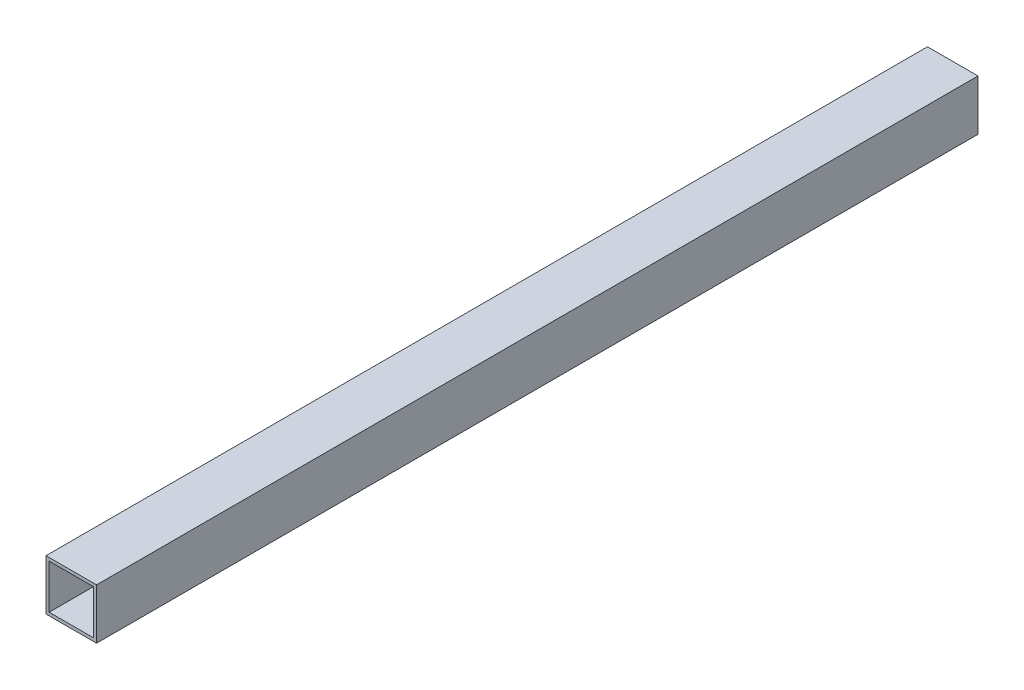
from build123d import *

# Parameters (mm, degrees)
SKETCH1_W           = 50.8
SKETCH1_H           = 50.8
SKETCH1_W_2         = 44.45
SKETCH1_H_2         = 44.45
BOSS_EXTRUDE1_DEPTH = 885.825


with BuildPart() as part:
    # Sketch1 → Boss-Extrude1 (new body)
    with BuildSketch(Plane.XY.offset(863.6)):
        Rectangle(SKETCH1_W, SKETCH1_H)
        Rectangle(SKETCH1_W_2, SKETCH1_H_2, mode=Mode.SUBTRACT)
    extrude(amount=-BOSS_EXTRUDE1_DEPTH)


solid = part.part
